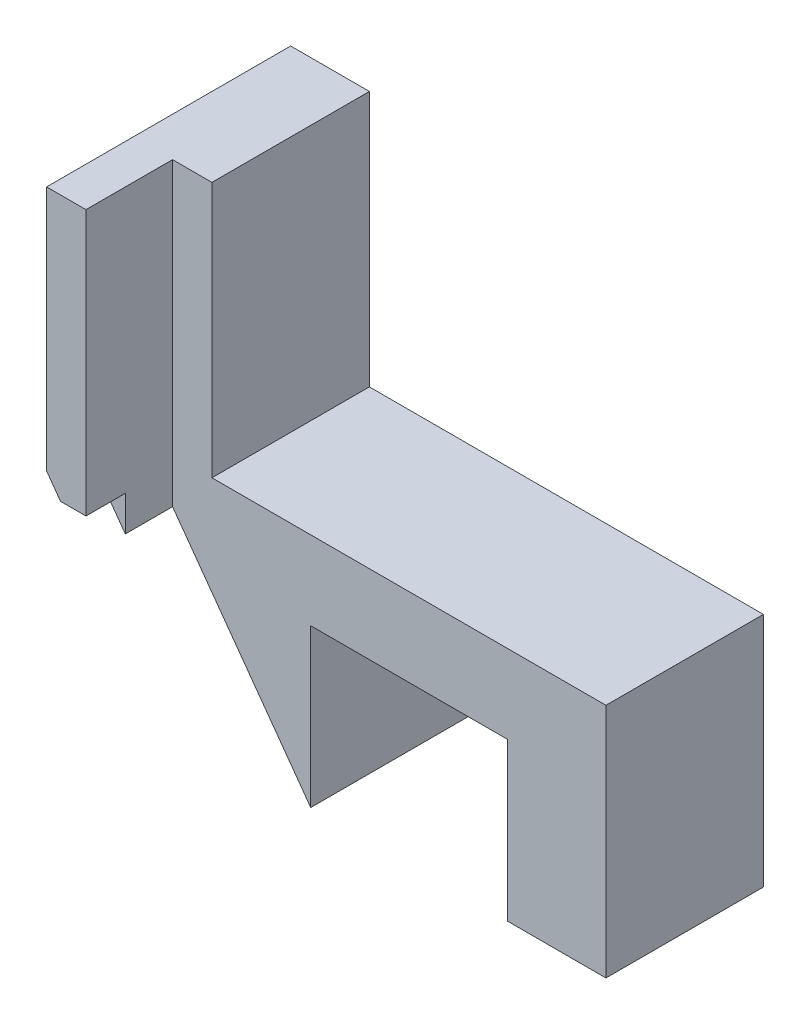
ISO-10303-21;
HEADER;
FILE_DESCRIPTION(('STEP AP214'),'2;1');
FILE_NAME('part.step','',(''),(''),'','','');
FILE_SCHEMA(('AUTOMOTIVE_DESIGN { 1 0 10303 214 1 1 1 1 }'));
ENDSEC;
DATA;
#1=APPLICATION_CONTEXT('core data for automotive mechanical design processes');
#2=APPLICATION_PROTOCOL_DEFINITION('international standard','automotive_design',2000,#1);
#3=PRODUCT_CONTEXT('',#1,'mechanical');
#4=PRODUCT('Part','Part','',(#3));
#5=PRODUCT_RELATED_PRODUCT_CATEGORY('part','',(#4));
#6=PRODUCT_DEFINITION_FORMATION('','',#4);
#7=PRODUCT_DEFINITION_CONTEXT('part definition',#1,'design');
#8=PRODUCT_DEFINITION('design','',#6,#7);
#9=PRODUCT_DEFINITION_SHAPE('','',#8);
#10=(LENGTH_UNIT() NAMED_UNIT(*) SI_UNIT(.MILLI.,.METRE.));
#11=(NAMED_UNIT(*) PLANE_ANGLE_UNIT() SI_UNIT($,.RADIAN.));
#12=(NAMED_UNIT(*) SI_UNIT($,.STERADIAN.) SOLID_ANGLE_UNIT());
#13=UNCERTAINTY_MEASURE_WITH_UNIT(LENGTH_MEASURE(1.E-05),#10,'distance_accuracy_value','');
#14=(GEOMETRIC_REPRESENTATION_CONTEXT(3) GLOBAL_UNCERTAINTY_ASSIGNED_CONTEXT((#13)) GLOBAL_UNIT_ASSIGNED_CONTEXT((#10,
#11,#12)) REPRESENTATION_CONTEXT('',''));
#15=CARTESIAN_POINT('',(0.,0.,0.));
#16=DIRECTION('',(0.,0.,1.));
#17=DIRECTION('',(1.,0.,0.));
#18=AXIS2_PLACEMENT_3D('',#15,#16,#17);
#19=CARTESIAN_POINT('',(0.,0.,4.));
#20=DIRECTION('',(0.,0.,-1.));
#21=DIRECTION('',(-1.,0.,0.));
#22=AXIS2_PLACEMENT_3D('',#19,#20,#21);
#23=PLANE('',#22);
#24=DIRECTION('',(0.,1.,0.));
#25=VECTOR('',#24,1.);
#26=CARTESIAN_POINT('',(-3.51,8.5,4.));
#27=LINE('',#26,#25);
#28=CARTESIAN_POINT('',(-3.51,0.864190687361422,4.));
#29=VERTEX_POINT('',#28);
#30=CARTESIAN_POINT('',(-3.51,8.5,4.));
#31=VERTEX_POINT('',#30);
#32=EDGE_CURVE('E38',#29,#31,#27,.T.);
#33=ORIENTED_EDGE('',*,*,#32,.F.);
#34=DIRECTION('',(0.585158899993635,-0.810918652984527,0.));
#35=VECTOR('',#34,1.);
#36=CARTESIAN_POINT('',(-1.89806506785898,-1.36964375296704,4.));
#37=LINE('',#36,#35);
#38=CARTESIAN_POINT('',(0.,-4.,4.));
#39=VERTEX_POINT('',#38);
#40=EDGE_CURVE('E158',#29,#39,#37,.T.);
#41=ORIENTED_EDGE('',*,*,#40,.T.);
#42=DIRECTION('',(0.,1.,0.));
#43=VECTOR('',#42,1.);
#44=CARTESIAN_POINT('',(0.,-4.,4.));
#45=LINE('',#44,#43);
#46=CARTESIAN_POINT('',(0.,0.,4.));
#47=VERTEX_POINT('',#46);
#48=EDGE_CURVE('E184',#39,#47,#45,.T.);
#49=ORIENTED_EDGE('',*,*,#48,.T.);
#50=DIRECTION('',(1.,0.,0.));
#51=VECTOR('',#50,1.);
#52=CARTESIAN_POINT('',(0.,0.,4.));
#53=LINE('',#52,#51);
#54=CARTESIAN_POINT('',(5.,0.,4.));
#55=VERTEX_POINT('',#54);
#56=EDGE_CURVE('E187',#47,#55,#53,.T.);
#57=ORIENTED_EDGE('',*,*,#56,.T.);
#58=DIRECTION('',(0.,-1.,0.));
#59=VECTOR('',#58,1.);
#60=CARTESIAN_POINT('',(5.,0.,4.));
#61=LINE('',#60,#59);
#62=CARTESIAN_POINT('',(5.,-4.,4.));
#63=VERTEX_POINT('',#62);
#64=EDGE_CURVE('E190',#55,#63,#61,.T.);
#65=ORIENTED_EDGE('',*,*,#64,.T.);
#66=DIRECTION('',(1.,0.,0.));
#67=VECTOR('',#66,1.);
#68=CARTESIAN_POINT('',(5.,-4.,4.));
#69=LINE('',#68,#67);
#70=CARTESIAN_POINT('',(7.5,-4.,4.));
#71=VERTEX_POINT('',#70);
#72=EDGE_CURVE('E192',#63,#71,#69,.T.);
#73=ORIENTED_EDGE('',*,*,#72,.T.);
#74=DIRECTION('',(0.,1.,0.));
#75=VECTOR('',#74,1.);
#76=CARTESIAN_POINT('',(7.5,-4.,4.));
#77=LINE('',#76,#75);
#78=CARTESIAN_POINT('',(7.5,2.,4.));
#79=VERTEX_POINT('',#78);
#80=EDGE_CURVE('E194',#71,#79,#77,.T.);
#81=ORIENTED_EDGE('',*,*,#80,.T.);
#82=DIRECTION('',(-1.,0.,0.));
#83=VECTOR('',#82,1.);
#84=CARTESIAN_POINT('',(7.5,2.,4.));
#85=LINE('',#84,#83);
#86=CARTESIAN_POINT('',(-2.51,2.,4.));
#87=VERTEX_POINT('',#86);
#88=EDGE_CURVE('E196',#79,#87,#85,.T.);
#89=ORIENTED_EDGE('',*,*,#88,.T.);
#90=DIRECTION('',(0.,-1.,0.));
#91=VECTOR('',#90,1.);
#92=CARTESIAN_POINT('',(-2.51,2.,4.));
#93=LINE('',#92,#91);
#94=CARTESIAN_POINT('',(-2.51,8.5,4.));
#95=VERTEX_POINT('',#94);
#96=EDGE_CURVE('E172',#95,#87,#93,.T.);
#97=ORIENTED_EDGE('',*,*,#96,.F.);
#98=DIRECTION('',(1.,0.,0.));
#99=VECTOR('',#98,1.);
#100=CARTESIAN_POINT('',(-2.51,8.5,4.));
#101=LINE('',#100,#99);
#102=EDGE_CURVE('E177',#31,#95,#101,.T.);
#103=ORIENTED_EDGE('',*,*,#102,.F.);
#104=EDGE_LOOP('',(#33,#41,#49,#57,#65,#73,#81,#89,#97,#103));
#105=FACE_BOUND('',#104,.T.);
#106=ADVANCED_FACE('F34',(#105),#23,.F.);
#107=CARTESIAN_POINT('',(0.,-4.,4.));
#108=DIRECTION('',(-1.,0.,0.));
#109=DIRECTION('',(0.,0.,1.));
#110=AXIS2_PLACEMENT_3D('',#107,#108,#109);
#111=PLANE('',#110);
#112=DIRECTION('',(0.,1.,0.));
#113=VECTOR('',#112,1.);
#114=CARTESIAN_POINT('',(0.,-4.,0.));
#115=LINE('',#114,#113);
#116=CARTESIAN_POINT('',(0.,-4.,0.));
#117=VERTEX_POINT('',#116);
#118=CARTESIAN_POINT('',(0.,0.,0.));
#119=VERTEX_POINT('',#118);
#120=EDGE_CURVE('E156',#117,#119,#115,.T.);
#121=ORIENTED_EDGE('',*,*,#120,.T.);
#122=DIRECTION('',(0.,0.,-1.));
#123=VECTOR('',#122,1.);
#124=CARTESIAN_POINT('',(0.,0.,4.));
#125=LINE('',#124,#123);
#126=EDGE_CURVE('E44',#47,#119,#125,.T.);
#127=ORIENTED_EDGE('',*,*,#126,.F.);
#128=ORIENTED_EDGE('',*,*,#48,.F.);
#129=DIRECTION('',(0.,0.,-1.));
#130=VECTOR('',#129,1.);
#131=CARTESIAN_POINT('',(0.,-4.,4.));
#132=LINE('',#131,#130);
#133=EDGE_CURVE('E198',#39,#117,#132,.T.);
#134=ORIENTED_EDGE('',*,*,#133,.T.);
#135=EDGE_LOOP('',(#121,#127,#128,#134));
#136=FACE_BOUND('',#135,.T.);
#137=ADVANCED_FACE('F36',(#136),#111,.F.);
#138=CARTESIAN_POINT('',(0.,0.,4.));
#139=DIRECTION('',(0.,1.,0.));
#140=DIRECTION('',(0.,0.,1.));
#141=AXIS2_PLACEMENT_3D('',#138,#139,#140);
#142=PLANE('',#141);
#143=DIRECTION('',(1.,0.,0.));
#144=VECTOR('',#143,1.);
#145=CARTESIAN_POINT('',(0.,0.,0.));
#146=LINE('',#145,#144);
#147=CARTESIAN_POINT('',(5.,0.,0.));
#148=VERTEX_POINT('',#147);
#149=EDGE_CURVE('E200',#119,#148,#146,.T.);
#150=ORIENTED_EDGE('',*,*,#149,.T.);
#151=DIRECTION('',(0.,0.,-1.));
#152=VECTOR('',#151,1.);
#153=CARTESIAN_POINT('',(5.,0.,4.));
#154=LINE('',#153,#152);
#155=EDGE_CURVE('E219',#55,#148,#154,.T.);
#156=ORIENTED_EDGE('',*,*,#155,.F.);
#157=ORIENTED_EDGE('',*,*,#56,.F.);
#158=ORIENTED_EDGE('',*,*,#126,.T.);
#159=EDGE_LOOP('',(#150,#156,#157,#158));
#160=FACE_BOUND('',#159,.T.);
#161=ADVANCED_FACE('F288',(#160),#142,.F.);
#162=CARTESIAN_POINT('',(5.,0.,4.));
#163=DIRECTION('',(1.,0.,0.));
#164=DIRECTION('',(0.,1.,0.));
#165=AXIS2_PLACEMENT_3D('',#162,#163,#164);
#166=PLANE('',#165);
#167=DIRECTION('',(0.,-1.,0.));
#168=VECTOR('',#167,1.);
#169=CARTESIAN_POINT('',(5.,0.,0.));
#170=LINE('',#169,#168);
#171=CARTESIAN_POINT('',(5.,-4.,0.));
#172=VERTEX_POINT('',#171);
#173=EDGE_CURVE('E202',#148,#172,#170,.T.);
#174=ORIENTED_EDGE('',*,*,#173,.T.);
#175=DIRECTION('',(0.,0.,-1.));
#176=VECTOR('',#175,1.);
#177=CARTESIAN_POINT('',(5.,-4.,4.));
#178=LINE('',#177,#176);
#179=EDGE_CURVE('E216',#63,#172,#178,.T.);
#180=ORIENTED_EDGE('',*,*,#179,.F.);
#181=ORIENTED_EDGE('',*,*,#64,.F.);
#182=ORIENTED_EDGE('',*,*,#155,.T.);
#183=EDGE_LOOP('',(#174,#180,#181,#182));
#184=FACE_BOUND('',#183,.T.);
#185=ADVANCED_FACE('F285',(#184),#166,.F.);
#186=CARTESIAN_POINT('',(5.,-4.,4.));
#187=DIRECTION('',(0.,1.,0.));
#188=DIRECTION('',(0.,0.,1.));
#189=AXIS2_PLACEMENT_3D('',#186,#187,#188);
#190=PLANE('',#189);
#191=DIRECTION('',(1.,0.,0.));
#192=VECTOR('',#191,1.);
#193=CARTESIAN_POINT('',(5.,-4.,0.));
#194=LINE('',#193,#192);
#195=CARTESIAN_POINT('',(7.5,-4.,0.));
#196=VERTEX_POINT('',#195);
#197=EDGE_CURVE('E204',#172,#196,#194,.T.);
#198=ORIENTED_EDGE('',*,*,#197,.T.);
#199=DIRECTION('',(0.,0.,-1.));
#200=VECTOR('',#199,1.);
#201=CARTESIAN_POINT('',(7.5,-4.,4.));
#202=LINE('',#201,#200);
#203=EDGE_CURVE('E213',#71,#196,#202,.T.);
#204=ORIENTED_EDGE('',*,*,#203,.F.);
#205=ORIENTED_EDGE('',*,*,#72,.F.);
#206=ORIENTED_EDGE('',*,*,#179,.T.);
#207=EDGE_LOOP('',(#198,#204,#205,#206));
#208=FACE_BOUND('',#207,.T.);
#209=ADVANCED_FACE('F280',(#208),#190,.F.);
#210=CARTESIAN_POINT('',(7.5,-4.,4.));
#211=DIRECTION('',(-1.,0.,0.));
#212=DIRECTION('',(0.,-1.,0.));
#213=AXIS2_PLACEMENT_3D('',#210,#211,#212);
#214=PLANE('',#213);
#215=DIRECTION('',(0.,1.,0.));
#216=VECTOR('',#215,1.);
#217=CARTESIAN_POINT('',(7.5,-4.,0.));
#218=LINE('',#217,#216);
#219=CARTESIAN_POINT('',(7.5,2.,0.));
#220=VERTEX_POINT('',#219);
#221=EDGE_CURVE('E206',#196,#220,#218,.T.);
#222=ORIENTED_EDGE('',*,*,#221,.T.);
#223=DIRECTION('',(0.,0.,-1.));
#224=VECTOR('',#223,1.);
#225=CARTESIAN_POINT('',(7.5,2.,4.));
#226=LINE('',#225,#224);
#227=EDGE_CURVE('E210',#79,#220,#226,.T.);
#228=ORIENTED_EDGE('',*,*,#227,.F.);
#229=ORIENTED_EDGE('',*,*,#80,.F.);
#230=ORIENTED_EDGE('',*,*,#203,.T.);
#231=EDGE_LOOP('',(#222,#228,#229,#230));
#232=FACE_BOUND('',#231,.T.);
#233=ADVANCED_FACE('F275',(#232),#214,.F.);
#234=CARTESIAN_POINT('',(7.5,2.,4.));
#235=DIRECTION('',(0.,-1.,0.));
#236=DIRECTION('',(0.,0.,-1.));
#237=AXIS2_PLACEMENT_3D('',#234,#235,#236);
#238=PLANE('',#237);
#239=DIRECTION('',(-1.,0.,0.));
#240=VECTOR('',#239,1.);
#241=CARTESIAN_POINT('',(7.5,2.,0.));
#242=LINE('',#241,#240);
#243=CARTESIAN_POINT('',(-2.51,2.,0.));
#244=VERTEX_POINT('',#243);
#245=EDGE_CURVE('E188',#220,#244,#242,.T.);
#246=ORIENTED_EDGE('',*,*,#245,.T.);
#247=DIRECTION('',(0.,0.,-1.));
#248=VECTOR('',#247,1.);
#249=CARTESIAN_POINT('',(-2.51,2.,4.));
#250=LINE('',#249,#248);
#251=EDGE_CURVE('E178',#87,#244,#250,.T.);
#252=ORIENTED_EDGE('',*,*,#251,.F.);
#253=ORIENTED_EDGE('',*,*,#88,.F.);
#254=ORIENTED_EDGE('',*,*,#227,.T.);
#255=EDGE_LOOP('',(#246,#252,#253,#254));
#256=FACE_BOUND('',#255,.T.);
#257=ADVANCED_FACE('F271',(#256),#238,.F.);
#258=CARTESIAN_POINT('',(0.,0.,0.));
#259=DIRECTION('',(0.,0.,-1.));
#260=DIRECTION('',(-1.,0.,0.));
#261=AXIS2_PLACEMENT_3D('',#258,#259,#260);
#262=PLANE('',#261);
#263=DIRECTION('',(0.585158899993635,-0.810918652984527,0.));
#264=VECTOR('',#263,1.);
#265=CARTESIAN_POINT('',(-1.89806506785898,-1.36964375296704,0.));
#266=LINE('',#265,#264);
#267=CARTESIAN_POINT('',(-4.51,2.25,0.));
#268=VERTEX_POINT('',#267);
#269=EDGE_CURVE('E139',#268,#117,#266,.T.);
#270=ORIENTED_EDGE('',*,*,#269,.F.);
#271=DIRECTION('',(0.,1.,0.));
#272=VECTOR('',#271,1.);
#273=CARTESIAN_POINT('',(-4.51,8.5,0.));
#274=LINE('',#273,#272);
#275=CARTESIAN_POINT('',(-4.51,8.5,0.));
#276=VERTEX_POINT('',#275);
#277=EDGE_CURVE('E153',#268,#276,#274,.T.);
#278=ORIENTED_EDGE('',*,*,#277,.T.);
#279=DIRECTION('',(1.,0.,0.));
#280=VECTOR('',#279,1.);
#281=CARTESIAN_POINT('',(-2.51,8.5,0.));
#282=LINE('',#281,#280);
#283=CARTESIAN_POINT('',(-2.51,8.5,0.));
#284=VERTEX_POINT('',#283);
#285=EDGE_CURVE('E163',#276,#284,#282,.T.);
#286=ORIENTED_EDGE('',*,*,#285,.T.);
#287=DIRECTION('',(0.,-1.,0.));
#288=VECTOR('',#287,1.);
#289=CARTESIAN_POINT('',(-2.51,2.,0.));
#290=LINE('',#289,#288);
#291=EDGE_CURVE('E166',#284,#244,#290,.T.);
#292=ORIENTED_EDGE('',*,*,#291,.T.);
#293=ORIENTED_EDGE('',*,*,#245,.F.);
#294=ORIENTED_EDGE('',*,*,#221,.F.);
#295=ORIENTED_EDGE('',*,*,#197,.F.);
#296=ORIENTED_EDGE('',*,*,#173,.F.);
#297=ORIENTED_EDGE('',*,*,#149,.F.);
#298=ORIENTED_EDGE('',*,*,#120,.F.);
#299=EDGE_LOOP('',(#270,#278,#286,#292,#293,#294,#295,#296,#297,#298));
#300=FACE_BOUND('',#299,.T.);
#301=ADVANCED_FACE('F151',(#300),#262,.T.);
#302=CARTESIAN_POINT('',(-2.51,2.,4.));
#303=DIRECTION('',(1.,0.,0.));
#304=DIRECTION('',(0.,1.,0.));
#305=AXIS2_PLACEMENT_3D('',#302,#303,#304);
#306=PLANE('',#305);
#307=ORIENTED_EDGE('',*,*,#291,.F.);
#308=DIRECTION('',(0.,0.,-1.));
#309=VECTOR('',#308,1.);
#310=CARTESIAN_POINT('',(-2.51,8.5,4.));
#311=LINE('',#310,#309);
#312=EDGE_CURVE('E181',#95,#284,#311,.T.);
#313=ORIENTED_EDGE('',*,*,#312,.F.);
#314=ORIENTED_EDGE('',*,*,#96,.T.);
#315=ORIENTED_EDGE('',*,*,#251,.T.);
#316=EDGE_LOOP('',(#307,#313,#314,#315));
#317=FACE_BOUND('',#316,.T.);
#318=ADVANCED_FACE('F265',(#317),#306,.T.);
#319=CARTESIAN_POINT('',(-2.51,8.5,4.));
#320=DIRECTION('',(0.,1.,0.));
#321=DIRECTION('',(0.,0.,1.));
#322=AXIS2_PLACEMENT_3D('',#319,#320,#321);
#323=PLANE('',#322);
#324=ORIENTED_EDGE('',*,*,#285,.F.);
#325=DIRECTION('',(0.,0.,-1.));
#326=VECTOR('',#325,1.);
#327=CARTESIAN_POINT('',(-4.51,8.5,4.));
#328=LINE('',#327,#326);
#329=CARTESIAN_POINT('',(-4.51,8.5,6.2));
#330=VERTEX_POINT('',#329);
#331=EDGE_CURVE('E161',#330,#276,#328,.T.);
#332=ORIENTED_EDGE('',*,*,#331,.F.);
#333=DIRECTION('',(-1.,0.,0.));
#334=VECTOR('',#333,1.);
#335=CARTESIAN_POINT('',(-4.51,8.5,6.2));
#336=LINE('',#335,#334);
#337=CARTESIAN_POINT('',(-3.51,8.5,6.2));
#338=VERTEX_POINT('',#337);
#339=EDGE_CURVE('E169',#338,#330,#336,.T.);
#340=ORIENTED_EDGE('',*,*,#339,.F.);
#341=DIRECTION('',(0.,0.,-1.));
#342=VECTOR('',#341,1.);
#343=CARTESIAN_POINT('',(-3.51,8.5,6.2));
#344=LINE('',#343,#342);
#345=EDGE_CURVE('E164',#338,#31,#344,.T.);
#346=ORIENTED_EDGE('',*,*,#345,.T.);
#347=ORIENTED_EDGE('',*,*,#102,.T.);
#348=ORIENTED_EDGE('',*,*,#312,.T.);
#349=EDGE_LOOP('',(#324,#332,#340,#346,#347,#348));
#350=FACE_BOUND('',#349,.T.);
#351=ADVANCED_FACE('F259',(#350),#323,.T.);
#352=CARTESIAN_POINT('',(-4.51,8.5,4.));
#353=DIRECTION('',(-1.,0.,0.));
#354=DIRECTION('',(0.,-1.,0.));
#355=AXIS2_PLACEMENT_3D('',#352,#353,#354);
#356=PLANE('',#355);
#357=DIRECTION('',(0.,0.,1.));
#358=VECTOR('',#357,1.);
#359=CARTESIAN_POINT('',(-4.51,2.25,-28.0126632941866));
#360=LINE('',#359,#358);
#361=CARTESIAN_POINT('',(-4.51,2.25,6.2));
#362=VERTEX_POINT('',#361);
#363=EDGE_CURVE('E136',#268,#362,#360,.T.);
#364=ORIENTED_EDGE('',*,*,#363,.T.);
#365=DIRECTION('',(0.,-1.,0.));
#366=VECTOR('',#365,1.);
#367=CARTESIAN_POINT('',(-4.51,8.5,6.2));
#368=LINE('',#367,#366);
#369=EDGE_CURVE('E232',#330,#362,#368,.T.);
#370=ORIENTED_EDGE('',*,*,#369,.F.);
#371=ORIENTED_EDGE('',*,*,#331,.T.);
#372=ORIENTED_EDGE('',*,*,#277,.F.);
#373=EDGE_LOOP('',(#364,#370,#371,#372));
#374=FACE_BOUND('',#373,.T.);
#375=ADVANCED_FACE('F160',(#374),#356,.T.);
#376=CARTESIAN_POINT('',(-3.51,8.5,6.2));
#377=DIRECTION('',(-1.,0.,0.));
#378=DIRECTION('',(0.,-1.,0.));
#379=AXIS2_PLACEMENT_3D('',#376,#377,#378);
#380=PLANE('',#379);
#381=DIRECTION('',(0.,1.,0.));
#382=VECTOR('',#381,1.);
#383=CARTESIAN_POINT('',(-3.51,-4.,5.2));
#384=LINE('',#383,#382);
#385=CARTESIAN_POINT('',(-3.51,0.86419068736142,5.2));
#386=VERTEX_POINT('',#385);
#387=CARTESIAN_POINT('',(-3.51,1.75854146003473,5.2));
#388=VERTEX_POINT('',#387);
#389=EDGE_CURVE('E237',#386,#388,#384,.T.);
#390=ORIENTED_EDGE('',*,*,#389,.F.);
#391=DIRECTION('',(0.,0.,-1.));
#392=VECTOR('',#391,1.);
#393=CARTESIAN_POINT('',(-3.51,0.864190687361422,6.2));
#394=LINE('',#393,#392);
#395=EDGE_CURVE('E51',#386,#29,#394,.T.);
#396=ORIENTED_EDGE('',*,*,#395,.T.);
#397=ORIENTED_EDGE('',*,*,#32,.T.);
#398=ORIENTED_EDGE('',*,*,#345,.F.);
#399=DIRECTION('',(0.,1.,0.));
#400=VECTOR('',#399,1.);
#401=CARTESIAN_POINT('',(-3.51,8.5,6.2));
#402=LINE('',#401,#400);
#403=CARTESIAN_POINT('',(-3.51,1.75854146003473,6.2));
#404=VERTEX_POINT('',#403);
#405=EDGE_CURVE('E230',#404,#338,#402,.T.);
#406=ORIENTED_EDGE('',*,*,#405,.F.);
#407=DIRECTION('',(0.,0.,1.));
#408=VECTOR('',#407,1.);
#409=CARTESIAN_POINT('',(-3.51,1.75854146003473,5.2));
#410=LINE('',#409,#408);
#411=EDGE_CURVE('E58',#388,#404,#410,.T.);
#412=ORIENTED_EDGE('',*,*,#411,.F.);
#413=EDGE_LOOP('',(#390,#396,#397,#398,#406,#412));
#414=FACE_BOUND('',#413,.T.);
#415=ADVANCED_FACE('F251',(#414),#380,.F.);
#416=CARTESIAN_POINT('',(-4.51,-4.,6.2));
#417=DIRECTION('',(0.,0.,1.));
#418=DIRECTION('',(1.,0.,0.));
#419=AXIS2_PLACEMENT_3D('',#416,#417,#418);
#420=PLANE('',#419);
#421=DIRECTION('',(-0.585158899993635,0.810918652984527,0.));
#422=VECTOR('',#421,1.);
#423=CARTESIAN_POINT('',(-1.54427333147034,-1.85993163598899,6.2));
#424=LINE('',#423,#422);
#425=CARTESIAN_POINT('',(-4.15536351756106,1.75854146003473,6.2));
#426=VERTEX_POINT('',#425);
#427=EDGE_CURVE('E142',#426,#362,#424,.T.);
#428=ORIENTED_EDGE('',*,*,#427,.F.);
#429=DIRECTION('',(-1.,0.,0.));
#430=VECTOR('',#429,1.);
#431=CARTESIAN_POINT('',(-4.51,1.75854146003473,6.2));
#432=LINE('',#431,#430);
#433=EDGE_CURVE('E157',#404,#426,#432,.T.);
#434=ORIENTED_EDGE('',*,*,#433,.F.);
#435=ORIENTED_EDGE('',*,*,#405,.T.);
#436=ORIENTED_EDGE('',*,*,#339,.T.);
#437=ORIENTED_EDGE('',*,*,#369,.T.);
#438=EDGE_LOOP('',(#428,#434,#435,#436,#437));
#439=FACE_BOUND('',#438,.T.);
#440=ADVANCED_FACE('F257',(#439),#420,.T.);
#441=CARTESIAN_POINT('',(-4.51,1.75854146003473,5.2));
#442=DIRECTION('',(0.,1.,0.));
#443=DIRECTION('',(0.,0.,1.));
#444=AXIS2_PLACEMENT_3D('',#441,#442,#443);
#445=PLANE('',#444);
#446=ORIENTED_EDGE('',*,*,#433,.T.);
#447=DIRECTION('',(0.,0.,-1.));
#448=VECTOR('',#447,1.);
#449=CARTESIAN_POINT('',(-4.15536351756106,1.75854146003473,5.2));
#450=LINE('',#449,#448);
#451=CARTESIAN_POINT('',(-4.15536351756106,1.75854146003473,5.2));
#452=VERTEX_POINT('',#451);
#453=EDGE_CURVE('E147',#426,#452,#450,.T.);
#454=ORIENTED_EDGE('',*,*,#453,.T.);
#455=DIRECTION('',(-1.,0.,0.));
#456=VECTOR('',#455,1.);
#457=CARTESIAN_POINT('',(-4.51,1.75854146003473,5.2));
#458=LINE('',#457,#456);
#459=EDGE_CURVE('E235',#388,#452,#458,.T.);
#460=ORIENTED_EDGE('',*,*,#459,.F.);
#461=ORIENTED_EDGE('',*,*,#411,.T.);
#462=EDGE_LOOP('',(#446,#454,#460,#461));
#463=FACE_BOUND('',#462,.T.);
#464=ADVANCED_FACE('F246',(#463),#445,.F.);
#465=CARTESIAN_POINT('',(-4.51,1.75854146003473,5.2));
#466=DIRECTION('',(0.,0.,-1.));
#467=DIRECTION('',(-1.,0.,0.));
#468=AXIS2_PLACEMENT_3D('',#465,#466,#467);
#469=PLANE('',#468);
#470=ORIENTED_EDGE('',*,*,#459,.T.);
#471=DIRECTION('',(0.585158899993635,-0.810918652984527,0.));
#472=VECTOR('',#471,1.);
#473=CARTESIAN_POINT('',(-4.27679492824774,1.92682223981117,5.2));
#474=LINE('',#473,#472);
#475=EDGE_CURVE('E11',#452,#386,#474,.T.);
#476=ORIENTED_EDGE('',*,*,#475,.T.);
#477=ORIENTED_EDGE('',*,*,#389,.T.);
#478=EDGE_LOOP('',(#470,#476,#477));
#479=FACE_BOUND('',#478,.T.);
#480=ADVANCED_FACE('F248',(#479),#469,.F.);
#481=CARTESIAN_POINT('',(0.,-4.,-28.0126632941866));
#482=DIRECTION('',(0.810918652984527,0.585158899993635,0.));
#483=DIRECTION('',(-0.585158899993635,0.810918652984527,0.));
#484=AXIS2_PLACEMENT_3D('',#481,#482,#483);
#485=PLANE('',#484);
#486=ORIENTED_EDGE('',*,*,#363,.F.);
#487=ORIENTED_EDGE('',*,*,#269,.T.);
#488=ORIENTED_EDGE('',*,*,#133,.F.);
#489=ORIENTED_EDGE('',*,*,#40,.F.);
#490=ORIENTED_EDGE('',*,*,#395,.F.);
#491=ORIENTED_EDGE('',*,*,#475,.F.);
#492=ORIENTED_EDGE('',*,*,#453,.F.);
#493=ORIENTED_EDGE('',*,*,#427,.T.);
#494=EDGE_LOOP('',(#486,#487,#488,#489,#490,#491,#492,#493));
#495=FACE_BOUND('',#494,.T.);
#496=ADVANCED_FACE('F138',(#495),#485,.F.);
#497=CLOSED_SHELL('',(#106,#137,#161,#185,#209,#233,#257,#301,#318,#351,#375,#415,#440,#464,
#480,#496));
#498=MANIFOLD_SOLID_BREP('B2',#497);
#499=ADVANCED_BREP_SHAPE_REPRESENTATION('',(#18,#498),#14);
#500=SHAPE_DEFINITION_REPRESENTATION(#9,#499);
ENDSEC;
END-ISO-10303-21;
